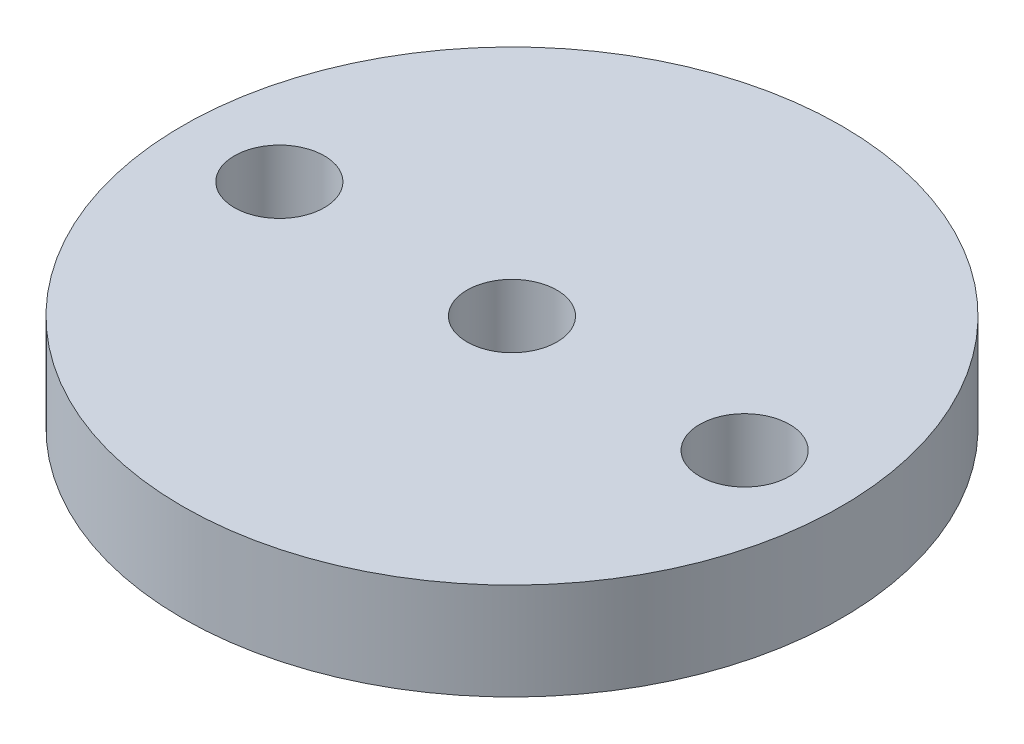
from build123d import *

# Parameters (mm, degrees)
SKETCH1_R             = 10.795
BOSS_EXTRUDE1_DEPTH   = 3.175
F_4_CLEARANCE_HOLE1_D = 2.9464


with BuildPart() as part:
    # Sketch1 → Boss-Extrude1 (new body)
    with BuildSketch(Plane(origin=(0, 0, 0), x_dir=(1, 0, 0), z_dir=(0, 1, 0))):
        with Locations(Location((0, 0, 0), (0, 0, 270))):
            Circle(SKETCH1_R)
    extrude(amount=BOSS_EXTRUDE1_DEPTH)

    # 4 Clearance Hole1 (through all)
    with Locations(Plane(origin=(0, 3.175, 0), x_dir=(1, 0, 0), z_dir=(0, 1, 0))):
        with Locations((-7.62, 0), (7.62, 0), (0, 0)):
            Hole(F_4_CLEARANCE_HOLE1_D / 2)


solid = part.part
